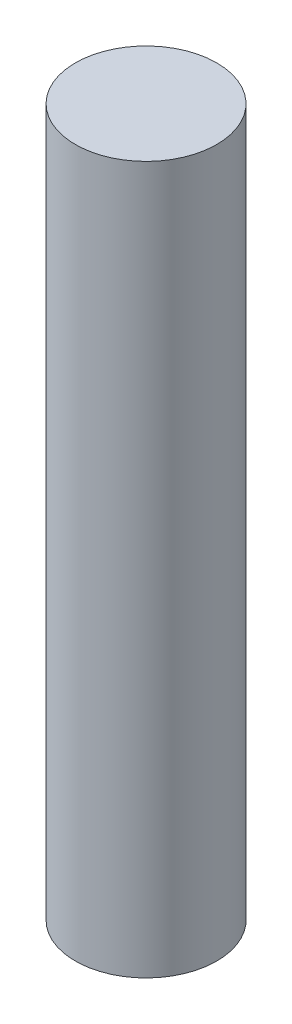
from build123d import *

# Parameters (mm, degrees)
SKETCH2_R           = 3.81
BOSS_EXTRUDE1_DEPTH = 19.05


with BuildPart() as part:
    # Sketch2 → Boss-Extrude1 (new, symmetric)
    with BuildSketch(Plane(origin=(0, 0, 0), x_dir=(1, 0, 0), z_dir=(0, 1, 0))):
        with Locations(Location((0, 0, 0), (0, 0, 90))):
            Circle(SKETCH2_R)
    extrude(amount=BOSS_EXTRUDE1_DEPTH, both=True)


solid = part.part
